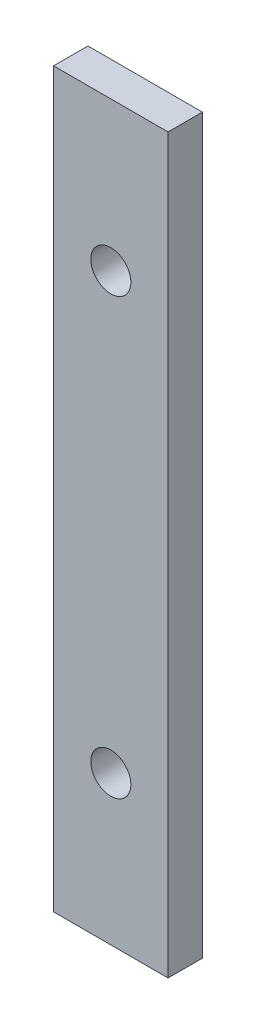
from build123d import *

# Parameters (mm, degrees)
SKETCH1_W      = 10
SKETCH1_H      = 64
SKETCH1_R      = 1.75
EXTRUDE1_DEPTH = 3


with BuildPart() as part:
    # Sketch1 → Extrude1 (new body)
    with BuildSketch(Plane.XY):
        with Locations((5, 32)):
            Rectangle(SKETCH1_W, SKETCH1_H)
        with Locations((5, 51)):
            Circle(SKETCH1_R, mode=Mode.SUBTRACT)
        with Locations((5, 13)):
            Circle(SKETCH1_R, mode=Mode.SUBTRACT)
    extrude(amount=EXTRUDE1_DEPTH)


solid = part.part
